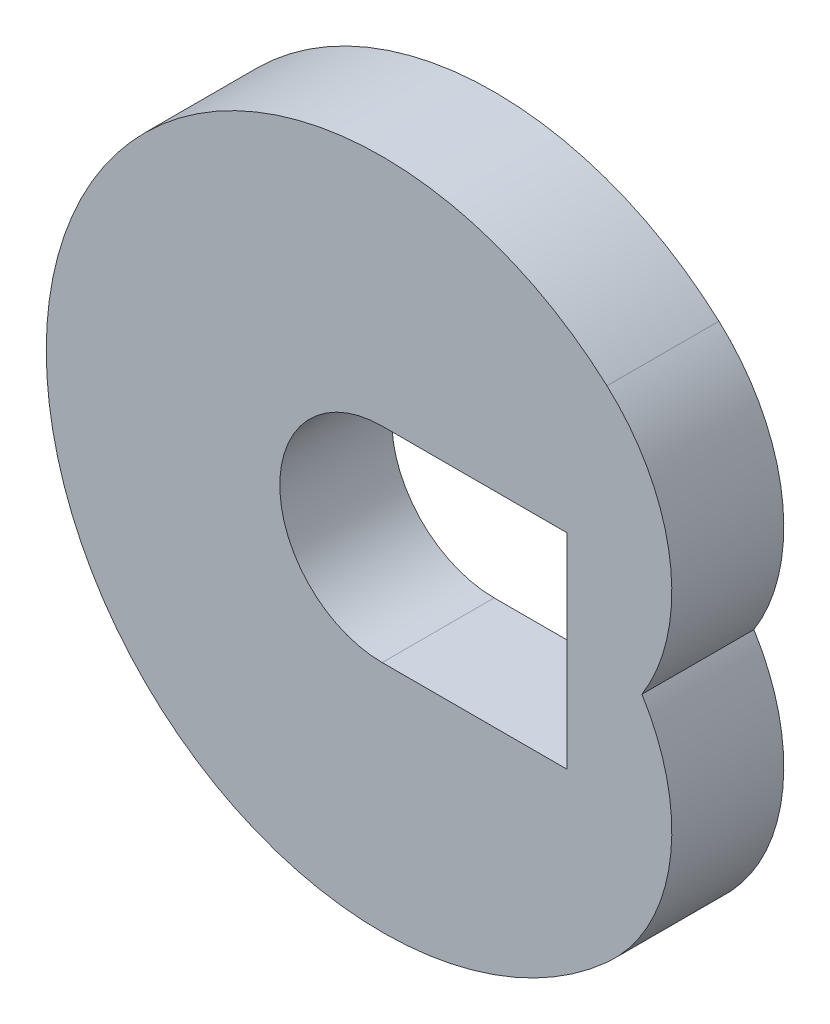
from build123d import *

# Parameters (mm, degrees)
EXTRUDE_1_DEPTH = 200


with BuildPart() as part:
    # Sketch 1 → Extrude 1 (new body)
    with BuildSketch(Plane.XY):
        with BuildLine():
            ThreePointArc((401.478363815, 445.886895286), (-600, 0), (401.478363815, -445.886895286))
            ThreePointArc((401.478363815, -445.886895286), (513.902238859, -234.313123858), (463.902754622, 0))
            ThreePointArc((463.902754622, 0), (513.902238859, 234.313123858), (401.478363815, 445.886895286))
        make_face()
        with BuildLine():
            Line((0, 182.881257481), (330, 182.881257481))
            Line((330, 182.881257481), (330, -182.881257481))
            Line((330, -182.881257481), (0, -182.881257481))
            ThreePointArc((0, -182.881257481), (-182.881257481, 0), (0, 182.881257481))
        make_face(mode=Mode.SUBTRACT)
    extrude(amount=EXTRUDE_1_DEPTH)


solid = part.part
